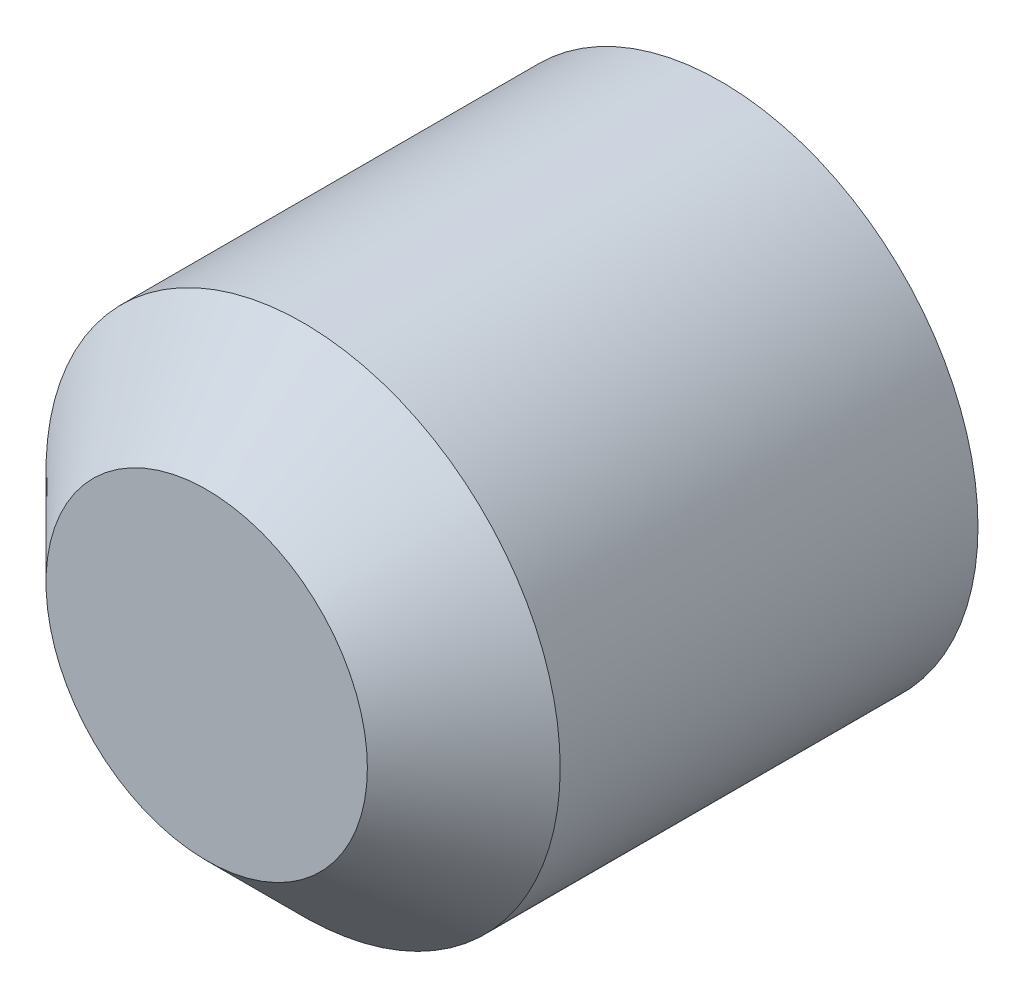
from build123d import *

# Parameters (mm, degrees)
ESQUISSE1_R          = 2
BASE_EXTRUSION_DEPTH = 4
CHANFREIN1_SIZE      = 0.75


with BuildPart() as part:
    # Esquisse1 → Base-Extrusion (new body)
    with BuildSketch(Plane.XY):
        Circle(ESQUISSE1_R)
    extrude(amount=BASE_EXTRUSION_DEPTH)

    # Chanfrein1
    chanfrein1_edges = [part.edges().sort_by_distance(p)[0] for p in [
        (-2, 0, 4),
    ]]
    chamfer(chanfrein1_edges, length=CHANFREIN1_SIZE)


solid = part.part
